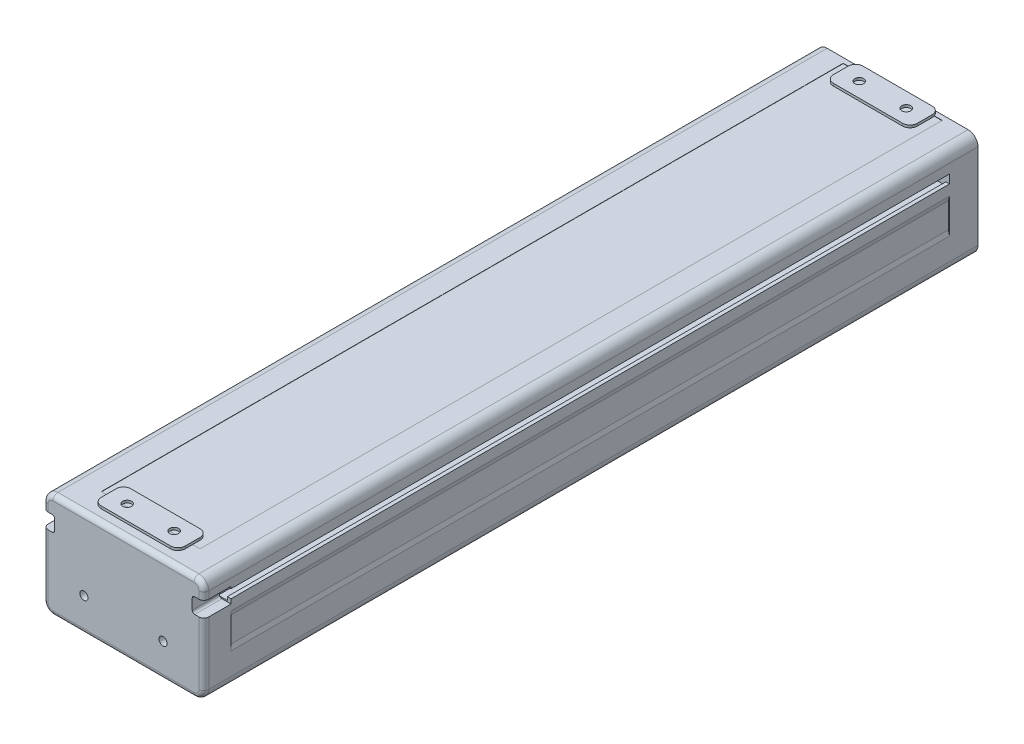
from build123d import *

# Parameters (mm, degrees)
EXTRUDE_1_DEPTH                     = 302
HOLE_WIZARD_M4_1_D                  = 4.4
HOLE_WIZARD_M4_1_CBORE_D            = 8
HOLE_WIZARD_M4_1_CBORE_DEPTH        = 4.2
PATTERN_LINEAR_1_COUNT              = 2
PATTERN_LINEAR_1_PITCH              = 23
PATTERN_LINEAR_2_COUNT              = 2
PATTERN_LINEAR_2_PITCH              = 11
PATTERN_LINEAR_2_COPY_1_D           = 4.4
PATTERN_LINEAR_2_COPY_1_CBORE_D     = 8
PATTERN_LINEAR_2_COPY_1_CBORE_DEPTH = 4.2
HOLE_WIZARD_M5_1_D                  = 4.2
PATTERN_LINEAR_4_COUNT              = 2
PATTERN_LINEAR_4_PITCH              = 23
PATTERN_LINEAR_5_COUNT              = 7
PATTERN_LINEAR_5_PITCH              = 40
PATTERN_LINEAR_5_COPY_1_D           = 4.2
PATTERN_LINEAR_5_COPY_2_D           = 4.2
PATTERN_LINEAR_5_COPY_3_D           = 4.2
PATTERN_LINEAR_5_COPY_4_D           = 4.2
PATTERN_LINEAR_5_COPY_5_D           = 4.2
PATTERN_LINEAR_5_COPY_6_D           = 4.2
HOLE_WIZARD_M4_2_D                  = 4.4
HOLE_WIZARD_M4_2_CBORE_D            = 8
HOLE_WIZARD_M4_2_CBORE_DEPTH        = 4.2
EXTRUDE_2_DEPTH                     = 290.5
EXTRUDE_6_DEPTH                     = 11
FILLET_1_R                          = 1
FILLET_2_R                          = 4
EXTRUDE_7_DEPTH                     = 11.5
CUT_EXTRUDE_1_DEPTH                 = 9
HOLE_WIZARD_M4_3_AT_2_COUNT         = 2
HOLE_WIZARD_M4_3_AT_2_PITCH         = 23
SKETCH_15_W                         = 34
SKETCH_15_H                         = 12
SKETCH_15_R                         = 1.8
EXTRUDE_8_DEPTH                     = 1
FILLET_3_R                          = 3
SKETCH_14_W                         = 40
SKETCH_14_H                         = 300
CUT_EXTRUDE_2_DEPTH                 = 0.1
FILLET_4_R                          = 2
HOLE_WIZARD_M4_1_2_D                = 3.3
HOLE_WIZARD_M4_1_2_DEPTH            = 14.1
HOLE_WIZARD_M4_1_2_TIP              = 0.991420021


with BuildPart() as part:
    # Sketch 1 → Extrude 1 (new body)
    with BuildSketch(Plane.XY):
        with BuildLine():
            Line((-20.85, 3.480384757), (-20.4, 3.740192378))
            ThreePointArc((-20.4, 3.740192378), (-20.290192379, 3.85), (-20.25, 4))
            Line((-20.25, 4), (-20.25, 5.134886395))
            ThreePointArc((-20.25, 5.134886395), (-19.030626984, 6.766047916), (-20.250994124, 8.396465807))
            Line((-20.250994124, 8.396465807), (-20.628312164, 9.05))
            ThreePointArc((-20.628312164, 9.05), (-20.628312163, 9.35), (-20.368504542, 9.5))
            Line((-20.368504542, 9.5), (20.368504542, 9.5))
            ThreePointArc((20.368504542, 9.5), (20.628312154, 9.350000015), (20.628312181, 9.050000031))
            Line((20.628312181, 9.050000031), (20.250994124, 8.396465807))
            ThreePointArc((20.250994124, 8.396465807), (19.030626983, 6.766047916), (20.25, 5.134886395))
            Line((20.25, 5.134886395), (20.25, 3.999999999))
            ThreePointArc((20.25, 3.999999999), (20.290192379, 3.85), (20.4, 3.740192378))
            Line((20.4, 3.740192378), (20.85, 3.480384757))
            ThreePointArc((20.85, 3.480384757), (20.959807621, 3.370577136), (21, 3.220577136))
            Line((21, 3.220577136), (21, 0.815685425))
            Line((21, 0.815685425), (20.184314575, 0))
            Line((20.184314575, 0), (9, 0))
            Line((9, 0), (8.5, 0.5))
            Line((8.5, 0.5), (-8.5, 0.5))
            Line((-8.5, 0.5), (-9, 0))
            Line((-9, 0), (-20.184314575, 0))
            Line((-20.184314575, 0), (-21, 0.815685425))
            Line((-21, 0.815685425), (-21, 3.220577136))
            ThreePointArc((-21, 3.220577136), (-20.959807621, 3.370577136), (-20.85, 3.480384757))
        make_face()
    extrude(amount=EXTRUDE_1_DEPTH)

    # Hole Wizard M4 _1 (through all)
    with Locations(Plane(origin=(-11.5, 0, 5), x_dir=(0, 0, -1), z_dir=(0, -1, 0))):
        with Locations((0, 0)):
            hole_wizard_m4_1 = CounterBoreHole(HOLE_WIZARD_M4_1_D / 2, HOLE_WIZARD_M4_1_CBORE_D / 2, HOLE_WIZARD_M4_1_CBORE_DEPTH)

    # Pattern Linear 1: Hole Wizard M4 _1 ×2
    with Locations(*[(i * PATTERN_LINEAR_1_PITCH, 0, 0) for i in range(1, PATTERN_LINEAR_1_COUNT)]):
        add(hole_wizard_m4_1, mode=Mode.SUBTRACT)

    # Pattern Linear 2: Hole Wizard M4 _1 ×2
    with Locations(*[(0, 0, i * PATTERN_LINEAR_2_PITCH) for i in range(1, PATTERN_LINEAR_2_COUNT)]):
        add(hole_wizard_m4_1, mode=Mode.SUBTRACT)

    # Pattern Linear 2 copy 1 (through all)
    with Locations(Plane(origin=(11.5, 0, 16), x_dir=(0, 0, -1), z_dir=(0, -1, 0))):
        with Locations((0, 0)):
            CounterBoreHole(PATTERN_LINEAR_2_COPY_1_D / 2, PATTERN_LINEAR_2_COPY_1_CBORE_D / 2, PATTERN_LINEAR_2_COPY_1_CBORE_DEPTH)

    # Hole Wizard M5 _1 (through all)
    with Locations(Plane(origin=(-11.5, 9.5, 27), x_dir=(0, 0, 1), z_dir=(0, 1, 0))):
        with Locations((0, 0)):
            hole_wizard_m5_1 = Hole(HOLE_WIZARD_M5_1_D / 2)

    # Pattern Linear 4: Hole Wizard M5 _1 ×2
    with Locations(*[(i * PATTERN_LINEAR_4_PITCH, 0, 0) for i in range(1, PATTERN_LINEAR_4_COUNT)]):
        add(hole_wizard_m5_1, mode=Mode.SUBTRACT)

    # Pattern Linear 5: Hole Wizard M5 _1 ×7
    with Locations(*[(0, 0, i * PATTERN_LINEAR_5_PITCH) for i in range(1, PATTERN_LINEAR_5_COUNT)]):
        add(hole_wizard_m5_1, mode=Mode.SUBTRACT)

    # Pattern Linear 5 copy 1 (through all)
    with Locations(Plane(origin=(11.5, 9.5, 67), x_dir=(0, 0, 1), z_dir=(0, 1, 0))):
        with Locations((0, 0)):
            Hole(PATTERN_LINEAR_5_COPY_1_D / 2)

    # Pattern Linear 5 copy 2 (through all)
    with Locations(Plane(origin=(11.5, 9.5, 107), x_dir=(0, 0, 1), z_dir=(0, 1, 0))):
        with Locations((0, 0)):
            Hole(PATTERN_LINEAR_5_COPY_2_D / 2)

    # Pattern Linear 5 copy 3 (through all)
    with Locations(Plane(origin=(11.5, 9.5, 147), x_dir=(0, 0, 1), z_dir=(0, 1, 0))):
        with Locations((0, 0)):
            Hole(PATTERN_LINEAR_5_COPY_3_D / 2)

    # Pattern Linear 5 copy 4 (through all)
    with Locations(Plane(origin=(11.5, 9.5, 187), x_dir=(0, 0, 1), z_dir=(0, 1, 0))):
        with Locations((0, 0)):
            Hole(PATTERN_LINEAR_5_COPY_4_D / 2)

    # Pattern Linear 5 copy 5 (through all)
    with Locations(Plane(origin=(11.5, 9.5, 227), x_dir=(0, 0, 1), z_dir=(0, 1, 0))):
        with Locations((0, 0)):
            Hole(PATTERN_LINEAR_5_COPY_5_D / 2)

    # Pattern Linear 5 copy 6 (through all)
    with Locations(Plane(origin=(11.5, 9.5, 267), x_dir=(0, 0, 1), z_dir=(0, 1, 0))):
        with Locations((0, 0)):
            Hole(PATTERN_LINEAR_5_COPY_6_D / 2)

    # Hole Wizard M4 _2 (through all)
    with Locations(Plane(origin=(-11.5, 0, 297), x_dir=(0, 0, -1), z_dir=(0, -1, 0))):
        with Locations((0, 0), (0, 23)):
            CounterBoreHole(HOLE_WIZARD_M4_2_D / 2, HOLE_WIZARD_M4_2_CBORE_D / 2, HOLE_WIZARD_M4_2_CBORE_DEPTH)

    # Sketch 10 → Extrude 6 (add)
    with BuildSketch(Plane.XY.offset(301)):
        Polygon((32.5, 43.9), (-32.5, 43.9), (-32.5, 37), (-27.8, 37), (-27.8, 30.8), (-32.5, 30.8), (-32.5, 1.4), (32.5, 1.4), (32.5, 30.8), (27.8, 30.8), (27.8, 37), (32.5, 37), align=None)
    extrude(amount=EXTRUDE_6_DEPTH)

    # Fillet 1
    fillet_1_edges = [part.edges().sort_by_distance(p)[0] for p in [
        (-27.8, 37, 306.5),
        (-27.8, 30.8, 306.5),
        (27.8, 30.8, 306.5),
        (27.8, 37, 306.5),
    ]]
    fillet(fillet_1_edges, radius=FILLET_1_R)

    # Fillet 2
    fillet_2_edges = [part.edges().sort_by_distance(p)[0] for p in [
        (-32.5, 1.4, 306.5),
        (-32.5, 43.9, 306.5),
        (32.5, 1.4, 306.5),
        (32.5, 43.9, 306.5),
    ]]
    fillet(fillet_2_edges, radius=FILLET_2_R)

    # Sketch 11 → Extrude 7 (add)
    with BuildSketch(Plane(origin=(0, 0, 10.5), x_dir=(-1, 0, 0), z_dir=(0, 0, -1))):
        with BuildLine():
            Line((-28.5, 43.9), (28.5, 43.9))
            ThreePointArc((28.5, 43.9), (31.328427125, 42.728427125), (32.5, 39.9))
            Line((32.5, 39.9), (32.5, 5.4))
            ThreePointArc((32.5, 5.4), (31.328427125, 2.571572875), (28.5, 1.4))
            Line((28.5, 1.4), (-28.5, 1.4))
            ThreePointArc((-28.5, 1.4), (-31.328427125, 2.571572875), (-32.5, 5.4))
            Line((-32.5, 5.4), (-32.5, 39.9))
            ThreePointArc((-32.5, 39.9), (-31.328427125, 42.728427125), (-28.5, 43.9))
        make_face()
    extrude(amount=EXTRUDE_7_DEPTH)

    # Sketch 12 → Cut-Extrude 1 (cut)
    with BuildSketch(Plane.XZ.offset(-0.5)):
        with BuildLine():
            Line((-21, 0), (21, 0))
            Line((21, 0), (21, -3))
            ThreePointArc((21, -3), (19.828427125, -5.828427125), (17, -7))
            Line((17, -7), (-17, -7))
            ThreePointArc((-17, -7), (-19.828427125, -5.828427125), (-21, -3))
            Line((-21, -3), (-21, 0))
        make_face()
        with BuildLine():
            Line((21, 302), (-21, 302))
            Line((-21, 302), (-21, 303))
            ThreePointArc((-21, 303), (-19.828427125, 305.828427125), (-17, 307))
            Line((-17, 307), (17, 307))
            ThreePointArc((17, 307), (19.828427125, 305.828427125), (21, 303))
            Line((21, 303), (21, 302))
        make_face()
    extrude(amount=-CUT_EXTRUDE_1_DEPTH, mode=Mode.SUBTRACT)

    # Sketch 20 → Hole Wizard M4 _3 (revolve, cut)
    with BuildSketch(Plane(origin=(-11.5, 0, 5), x_dir=(0, 0, -1), z_dir=(1, 0, 0))):
        Polygon((0, 0), (0, 8), (2.2, 8), (2.2, 5), (2.1, 5), (2.1, 0), align=None)
    hole_wizard_m4_3 = revolve(axis=Axis((-11.5, -6.35, 5), (0, 1, 0)), mode=Mode.SUBTRACT)

    # Hole Wizard M4 _3 at 2: Hole Wizard M4 _3 ×2
    with Locations(*[(i * HOLE_WIZARD_M4_3_AT_2_PITCH, 0, 0) for i in range(1, HOLE_WIZARD_M4_3_AT_2_COUNT)]):
        add(hole_wizard_m4_3, mode=Mode.SUBTRACT)



with BuildPart() as body_2:
    # Sketch 9 → Extrude 2 (new body)
    with BuildSketch(Plane.XY.offset(301)):
        with BuildLine():
            Line((-32, 26.5), (-32, 16.3))
            Line((-32, 16.3), (-32.5, 14.4))
            Line((-32.5, 14.4), (-32.5, 5.4))
            ThreePointArc((-32.5, 5.4), (-31.328427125, 2.571572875), (-28.5, 1.4))
            Line((-28.5, 1.4), (-18.5, 1.4))
            Line((-18.5, 1.4), (-18.5, 9.5))
            Line((-18.5, 9.5), (18.5, 9.5))
            Line((18.5, 9.5), (18.5, 1.4))
            Line((18.5, 1.4), (28.5, 1.4))
            ThreePointArc((28.5, 1.4), (31.328427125, 2.571572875), (32.5, 5.4))
            Line((32.5, 5.4), (32.5, 14.4))
            Line((32.5, 14.4), (32, 16.3))
            Line((32, 16.3), (32, 26.5))
            Line((32, 26.5), (32.5, 28.4))
            Line((32.5, 28.4), (32.5, 32.65))
            Line((32.5, 32.65), (31, 32.65))
            Line((31, 32.65), (31, 31.3))
            Line((31, 31.3), (27.3, 31.3))
            Line((27.3, 31.3), (27.3, 37.5))
            Line((27.3, 37.5), (31, 37.5))
            Line((31, 37.5), (31, 36.15))
            Line((31, 36.15), (32.5, 36.15))
            Line((32.5, 36.15), (32.5, 39.9))
            ThreePointArc((32.5, 39.9), (31.328427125, 42.728427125), (28.5, 43.9))
            Line((28.5, 43.9), (0, 43.9))
            Line((0, 43.9), (-28.5, 43.9))
            ThreePointArc((-28.5, 43.9), (-31.328427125, 42.728427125), (-32.5, 39.9))
            Line((-32.5, 39.9), (-32.5, 36.15))
            Line((-32.5, 36.15), (-31, 36.15))
            Line((-31, 36.15), (-31, 37.5))
            Line((-31, 37.5), (-27.3, 37.5))
            Line((-27.3, 37.5), (-27.3, 31.3))
            Line((-27.3, 31.3), (-31, 31.3))
            Line((-31, 31.3), (-31, 32.65))
            Line((-31, 32.65), (-32.5, 32.65))
            Line((-32.5, 32.65), (-32.5, 28.4))
            Line((-32.5, 28.4), (-32, 26.5))
        make_face()
    extrude(amount=-EXTRUDE_2_DEPTH)


with BuildPart() as part_1:
    add(part.part)

    add(body_2.part)  # Extrude 8 merges body 2
    # Sketch 15 → Extrude 8 (add)
    # profile 1 of 2: a face of its own
    with BuildSketch(Plane(origin=(0, 43.9, 0), x_dir=(1, 0, 0), z_dir=(0, 1, 0))):
        with Locations((0, -5)):
            Rectangle(SKETCH_15_W, SKETCH_15_H)
        with Locations(Location((-9.5, -5, 0), (0, 0, 270))):
            Circle(SKETCH_15_R, mode=Mode.SUBTRACT)
        with Locations(Location((9.5, -5, 0), (0, 0, 90))):
            Circle(SKETCH_15_R, mode=Mode.SUBTRACT)
    # profile 2 of 2: a face of its own
    with BuildSketch(Plane(origin=(0, 43.9, 0), x_dir=(1, 0, 0), z_dir=(0, 1, 0))):
        with Locations((0, -301)):
            Rectangle(SKETCH_15_W, SKETCH_15_H)
        with Locations(Location((-9.5, -301, 0), (0, 0, 270))):
            Circle(SKETCH_15_R, mode=Mode.SUBTRACT)
        with Locations(Location((9.5, -301, 0), (0, 0, 90))):
            Circle(SKETCH_15_R, mode=Mode.SUBTRACT)
    extrude(amount=EXTRUDE_8_DEPTH)

    # Fillet 3
    fillet_3_edges = [part_1.edges().sort_by_distance(p)[0] for p in [
        (-17, 44.4, -1),
        (-17, 44.4, 11),
        (17, 44.4, 11),
        (17, 44.4, -1),
        (-17, 44.4, 295),
        (-17, 44.4, 307),
        (17, 44.4, 307),
        (17, 44.4, 295),
    ]]
    fillet(fillet_3_edges, radius=FILLET_3_R)

    # Sketch 14 → Cut-Extrude 2 (cut)
    with BuildSketch(Plane(origin=(0, 43.9, 0), x_dir=(1, 0, 0), z_dir=(0, 1, 0))):
        with Locations((0, -151)):
            Rectangle(SKETCH_14_W, SKETCH_14_H)
    extrude(amount=-CUT_EXTRUDE_2_DEPTH, mode=Mode.SUBTRACT)

    # Fillet 4
    fillet_4_edges = [part_1.edges().sort_by_distance(p)[0] for p in [
        (-32.5, 18.1, 312),
        (-31.328427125, 2.571572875, 312),
        (0, 1.4, 312),
        (31.328427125, 2.571572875, 312),
        (32.5, 18.1, 312),
        (32.5, 38.45, 312),
        (31.328427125, 42.728427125, 312),
        (0, 43.9, 312),
        (-31.328427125, 42.728427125, 312),
        (-32.5, 38.45, 312),
    ]]
    fillet(fillet_4_edges, radius=FILLET_4_R)

    # Hole Wizard M4 _1 2
    with Locations(Plane.XY.offset(312)):
        with Locations((16, 15), (-16, 15)):
            Hole(HOLE_WIZARD_M4_1_2_D / 2, depth=HOLE_WIZARD_M4_1_2_DEPTH)
            with Locations((0, 0, -(HOLE_WIZARD_M4_1_2_DEPTH + HOLE_WIZARD_M4_1_2_TIP / 2))):  # 118° drill point
                Cone(0, HOLE_WIZARD_M4_1_2_D / 2, HOLE_WIZARD_M4_1_2_TIP, mode=Mode.SUBTRACT)


solid = part_1.part
